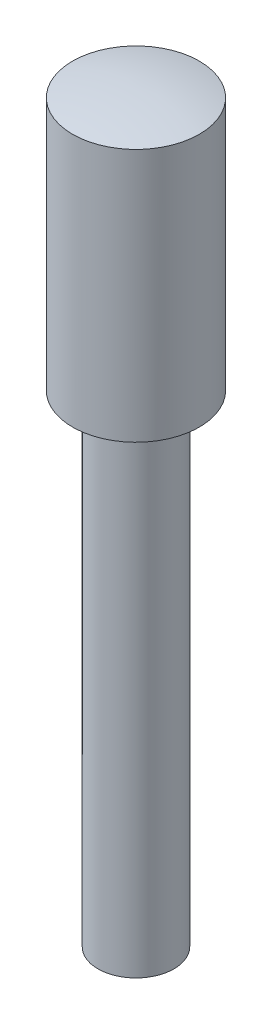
from build123d import *


with BuildPart() as part:
    # Esquisse1 → R_volution1 (revolve)
    with BuildSketch(Plane.XY):
        with BuildLine():
            Line((0, 0), (-0.5, 0))
            Line((-0.5, 0), (-0.5, 5))
            ThreePointArc((-0.5, 5), (0.120281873, 5.115266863), (0.75, 5.153882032))
            Line((0.75, 5.153882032), (0.75, -9.636000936))
            ThreePointArc((0.75, -9.636000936), (0.368884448, -9.601725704), (0, -9.5))
            Line((0, -9.5), (0, 0))
        make_face()
    revolve(axis=Axis((0.75, 5.569210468, 0), (0, -1, 0)))


solid = part.part
